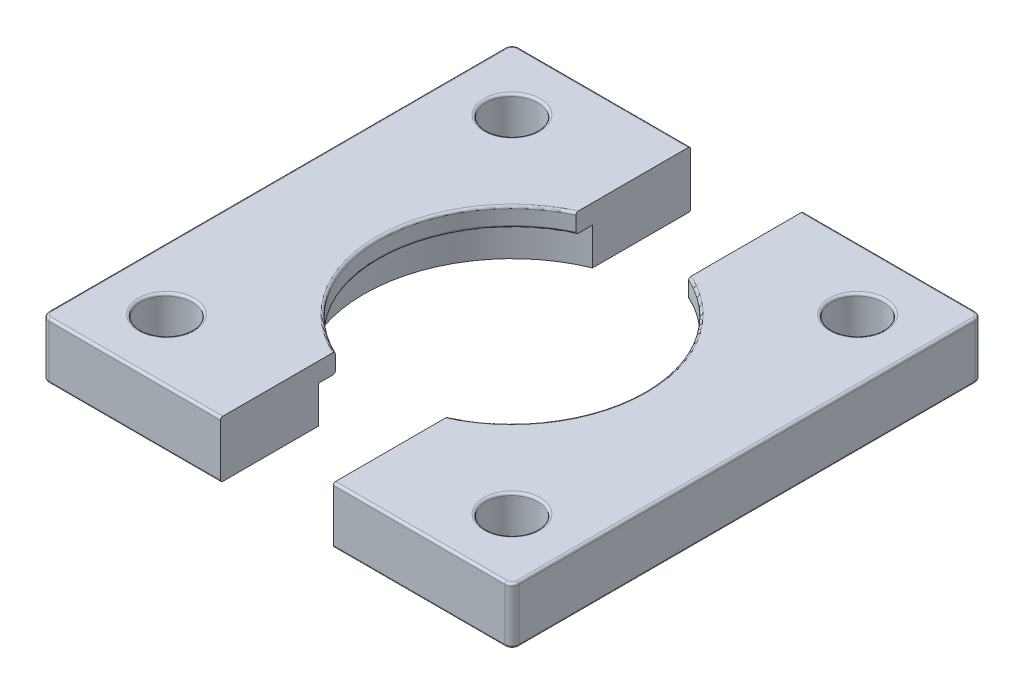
from build123d import *

# Parameters (mm, degrees)
SKETCH1_R             = 5.5
BOSS_EXTRUDE1_DEPTH   = 12
BOSS_EXTRUDE1_2_DEPTH = 12
SKETCH2_R             = 31.5
CUT_EXTRUDE1_DEPTH    = 7.9
FILLET1_R             = 0.5
FILLET2_R             = 0.5


with BuildPart() as part:
    # Sketch1 → Boss-Extrude1 (new body)
    with BuildSketch(Plane(origin=(0, 0, 0), x_dir=(1, 0, 0), z_dir=(0, 1, 0))):
        with BuildLine():
            Line((12, 50), (12, 25.574645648))
            ThreePointArc((12, 25.574645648), (28.25, 0), (12, -25.574645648))
            Line((12, -25.574645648), (12, -50))
            Line((12, -50), (48.5, -50))
            ThreePointArc((48.5, -50), (49.560660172, -49.560660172), (50, -48.5))
            Line((50, -48.5), (50, 48.5))
            ThreePointArc((50, 48.5), (49.560660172, 49.560660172), (48.5, 50))
            Line((48.5, 50), (12, 50))
        make_face()
        with Locations(Location((36.75, 36.75, 0), (0, 0, 90))):
            Circle(SKETCH1_R, mode=Mode.SUBTRACT)
        with Locations(Location((36.75, -36.75, 0), (0, 0, 270))):
            Circle(SKETCH1_R, mode=Mode.SUBTRACT)
    extrude(amount=BOSS_EXTRUDE1_DEPTH)


with BuildPart() as body_2:
    # Sketch1 → Boss-Extrude1 2 (new body)
    with BuildSketch(Plane(origin=(0, 0, 0), x_dir=(1, 0, 0), z_dir=(0, 1, 0))):
        with BuildLine():
            Line((-48.5, 50), (-12, 50))
            Line((-12, 50), (-12, 25.574645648))
            ThreePointArc((-12, 25.574645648), (-28.25, 0), (-12, -25.574645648))
            Line((-12, -25.574645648), (-12, -50))
            Line((-12, -50), (-48.5, -50))
            ThreePointArc((-48.5, -50), (-49.560660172, -49.560660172), (-50, -48.5))
            Line((-50, -48.5), (-50, 48.5))
            ThreePointArc((-50, 48.5), (-49.560660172, 49.560660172), (-48.5, 50))
        make_face()
        with Locations(Location((-36.75, 36.75, 0), (0, 0, 270))):
            Circle(SKETCH1_R, mode=Mode.SUBTRACT)
        with Locations(Location((-36.75, -36.75, 0), (0, 0, 90))):
            Circle(SKETCH1_R, mode=Mode.SUBTRACT)
    extrude(amount=BOSS_EXTRUDE1_2_DEPTH)


with BuildPart() as cut_extrude1_tool:
    # Sketch2 → Cut-Extrude1 (new body)
    with BuildSketch(Plane.XZ):
        Circle(SKETCH2_R)
    extrude(amount=-CUT_EXTRUDE1_DEPTH)


with BuildPart() as part_1:
    add(part.part)

    # Cut-Extrude1: cut by cut_extrude1_tool
    add(cut_extrude1_tool.part, mode=Mode.SUBTRACT)

    # Fillet1
    fillet1_edges = [part_1.edges().sort_by_distance(p)[0] for p in [
        (49.560660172, 12, -49.560660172),
        (50, 0, 0),
        (49.560660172, 0, 49.560660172),
        (30.25, 12, -50),
        (28.25, 12, 0),
        (36.75, 12, -31.25),
        (36.75, 12, 31.25),
        (30.25, 12, 50),
        (28.25, 7.9, 0),
        (49.560660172, 12, 49.560660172),
        (50, 12, 0),
        (30.25, 0, 50),
        (30.25, 0, -50),
        (49.560660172, 0, -49.560660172),
    ]]
    fillet(fillet1_edges, radius=FILLET1_R)


with BuildPart() as body_2_1:
    add(body_2.part)

    # Cut-Extrude1: cut by cut_extrude1_tool
    add(cut_extrude1_tool.part, mode=Mode.SUBTRACT)

    # Fillet2
    fillet2_edges = [body_2_1.edges().sort_by_distance(p)[0] for p in [
        (-30.25, 0, 50),
        (-49.560660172, 0, 49.560660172),
        (-28.25, 12, 0),
        (-30.25, 12, -50),
        (-36.75, 12, -42.25),
        (-49.560660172, 12, -49.560660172),
        (-36.75, 12, 42.25),
        (-50, 12, 0),
        (-28.25, 7.9, 0),
        (-49.560660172, 12, 49.560660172),
        (-30.25, 12, 50),
        (-50, 0, 0),
        (-49.560660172, 0, -49.560660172),
        (-30.25, 0, -50),
    ]]
    fillet(fillet2_edges, radius=FILLET2_R)


solid = Compound([part_1.part, body_2_1.part])
